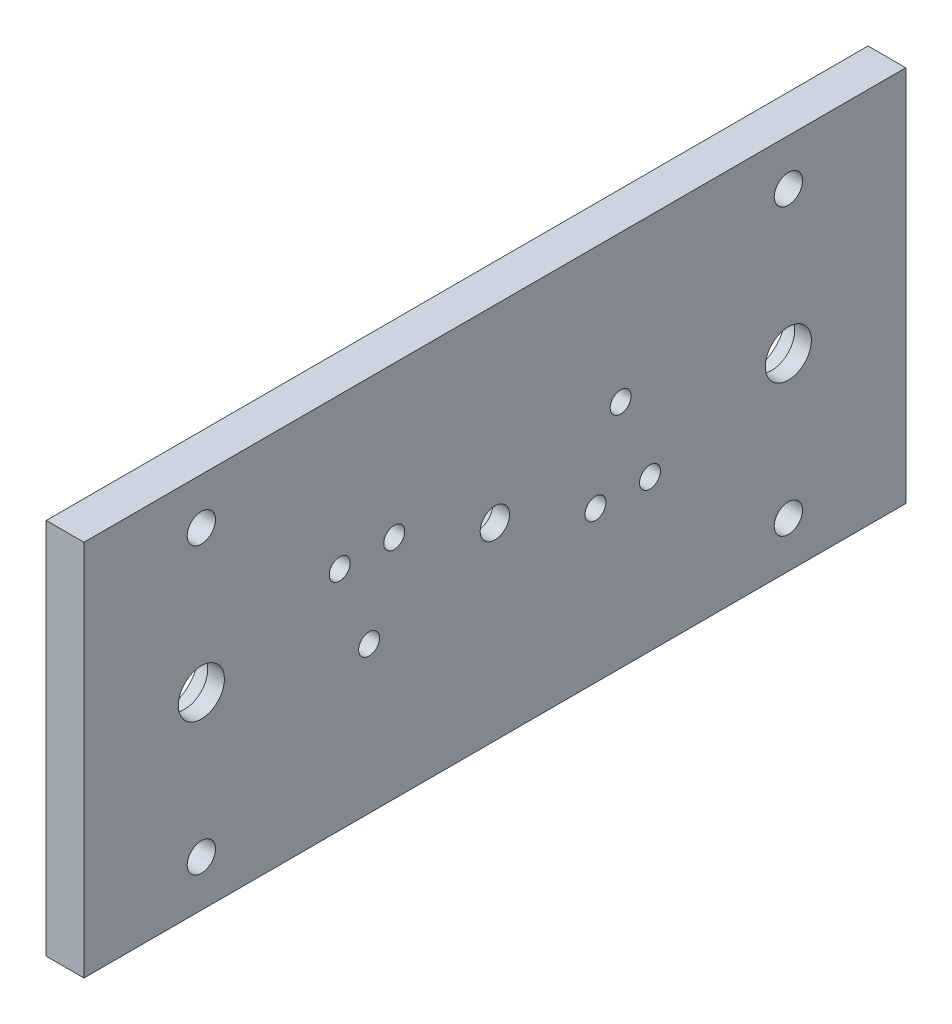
ISO-10303-21;
HEADER;
FILE_DESCRIPTION(('STEP AP214'),'2;1');
FILE_NAME('part.step','',(''),(''),'','','');
FILE_SCHEMA(('AUTOMOTIVE_DESIGN { 1 0 10303 214 1 1 1 1 }'));
ENDSEC;
DATA;
#1=APPLICATION_CONTEXT('core data for automotive mechanical design processes');
#2=APPLICATION_PROTOCOL_DEFINITION('international standard','automotive_design',2000,#1);
#3=PRODUCT_CONTEXT('',#1,'mechanical');
#4=PRODUCT('Part','Part','',(#3));
#5=PRODUCT_RELATED_PRODUCT_CATEGORY('part','',(#4));
#6=PRODUCT_DEFINITION_FORMATION('','',#4);
#7=PRODUCT_DEFINITION_CONTEXT('part definition',#1,'design');
#8=PRODUCT_DEFINITION('design','',#6,#7);
#9=PRODUCT_DEFINITION_SHAPE('','',#8);
#10=(LENGTH_UNIT() NAMED_UNIT(*) SI_UNIT(.MILLI.,.METRE.));
#11=(NAMED_UNIT(*) PLANE_ANGLE_UNIT() SI_UNIT($,.RADIAN.));
#12=(NAMED_UNIT(*) SI_UNIT($,.STERADIAN.) SOLID_ANGLE_UNIT());
#13=UNCERTAINTY_MEASURE_WITH_UNIT(LENGTH_MEASURE(1.E-05),#10,'distance_accuracy_value','');
#14=(GEOMETRIC_REPRESENTATION_CONTEXT(3) GLOBAL_UNCERTAINTY_ASSIGNED_CONTEXT((#13)) GLOBAL_UNIT_ASSIGNED_CONTEXT((#10,
#11,#12)) REPRESENTATION_CONTEXT('',''));
#15=CARTESIAN_POINT('',(0.,0.,0.));
#16=DIRECTION('',(0.,0.,1.));
#17=DIRECTION('',(1.,0.,0.));
#18=AXIS2_PLACEMENT_3D('',#15,#16,#17);
#19=CARTESIAN_POINT('',(-119.,78.,28.0000000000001));
#20=DIRECTION('',(-1.,0.,0.));
#21=DIRECTION('',(0.,0.,1.));
#22=AXIS2_PLACEMENT_3D('',#19,#20,#21);
#23=CYLINDRICAL_SURFACE('',#22,5.5);
#24=CARTESIAN_POINT('',(-119.,78.,28.0000000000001));
#25=DIRECTION('',(-1.,0.,0.));
#26=DIRECTION('',(0.,0.,1.));
#27=AXIS2_PLACEMENT_3D('',#24,#25,#26);
#28=CIRCLE('',#27,5.5);
#29=CARTESIAN_POINT('',(-119.,78.,33.5000000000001));
#30=VERTEX_POINT('',#29);
#31=EDGE_CURVE('E158',#30,#30,#28,.T.);
#32=ORIENTED_EDGE('',*,*,#31,.F.);
#33=EDGE_LOOP('',(#32));
#34=FACE_BOUND('',#33,.T.);
#35=CARTESIAN_POINT('',(-123.,78.,28.0000000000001));
#36=DIRECTION('',(-1.,0.,0.));
#37=DIRECTION('',(0.,0.,1.));
#38=AXIS2_PLACEMENT_3D('',#35,#36,#37);
#39=CIRCLE('',#38,5.5);
#40=CARTESIAN_POINT('',(-123.,78.,33.5000000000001));
#41=VERTEX_POINT('',#40);
#42=EDGE_CURVE('E32',#41,#41,#39,.F.);
#43=ORIENTED_EDGE('',*,*,#42,.F.);
#44=EDGE_LOOP('',(#43));
#45=FACE_BOUND('',#44,.T.);
#46=ADVANCED_FACE('F28',(#34,#45),#23,.F.);
#47=CARTESIAN_POINT('',(-119.,78.,168.));
#48=DIRECTION('',(-1.,0.,0.));
#49=DIRECTION('',(0.,0.,1.));
#50=AXIS2_PLACEMENT_3D('',#47,#48,#49);
#51=CYLINDRICAL_SURFACE('',#50,5.50000000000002);
#52=CARTESIAN_POINT('',(-119.,78.,168.));
#53=DIRECTION('',(-1.,0.,0.));
#54=DIRECTION('',(0.,0.,1.));
#55=AXIS2_PLACEMENT_3D('',#52,#53,#54);
#56=CIRCLE('',#55,5.50000000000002);
#57=CARTESIAN_POINT('',(-119.,78.,173.5));
#58=VERTEX_POINT('',#57);
#59=EDGE_CURVE('E163',#58,#58,#56,.T.);
#60=ORIENTED_EDGE('',*,*,#59,.F.);
#61=EDGE_LOOP('',(#60));
#62=FACE_BOUND('',#61,.T.);
#63=CARTESIAN_POINT('',(-123.,78.,168.));
#64=DIRECTION('',(-1.,0.,0.));
#65=DIRECTION('',(0.,0.,1.));
#66=AXIS2_PLACEMENT_3D('',#63,#64,#65);
#67=CIRCLE('',#66,5.50000000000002);
#68=CARTESIAN_POINT('',(-123.,78.,173.5));
#69=VERTEX_POINT('',#68);
#70=EDGE_CURVE('E156',#69,#69,#67,.F.);
#71=ORIENTED_EDGE('',*,*,#70,.F.);
#72=EDGE_LOOP('',(#71));
#73=FACE_BOUND('',#72,.T.);
#74=ADVANCED_FACE('F253',(#62,#73),#51,.F.);
#75=CARTESIAN_POINT('',(-128.,78.,98.0000000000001));
#76=DIRECTION('',(1.,0.,0.));
#77=DIRECTION('',(0.,0.,-1.));
#78=AXIS2_PLACEMENT_3D('',#75,#76,#77);
#79=CYLINDRICAL_SURFACE('',#78,3.50000000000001);
#80=CARTESIAN_POINT('',(-119.,78.,98.0000000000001));
#81=DIRECTION('',(1.,0.,0.));
#82=DIRECTION('',(0.,0.,-1.));
#83=AXIS2_PLACEMENT_3D('',#80,#81,#82);
#84=CIRCLE('',#83,3.50000000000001);
#85=CARTESIAN_POINT('',(-119.,78.,94.5000000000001));
#86=VERTEX_POINT('',#85);
#87=EDGE_CURVE('E121',#86,#86,#84,.T.);
#88=ORIENTED_EDGE('',*,*,#87,.T.);
#89=EDGE_LOOP('',(#88));
#90=FACE_BOUND('',#89,.T.);
#91=CARTESIAN_POINT('',(-123.,78.,98.0000000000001));
#92=DIRECTION('',(-1.,0.,0.));
#93=DIRECTION('',(0.,0.,1.));
#94=AXIS2_PLACEMENT_3D('',#91,#92,#93);
#95=CIRCLE('',#94,3.50000000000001);
#96=CARTESIAN_POINT('',(-123.,78.,101.5));
#97=VERTEX_POINT('',#96);
#98=EDGE_CURVE('E152',#97,#97,#95,.F.);
#99=ORIENTED_EDGE('',*,*,#98,.F.);
#100=EDGE_LOOP('',(#99));
#101=FACE_BOUND('',#100,.T.);
#102=ADVANCED_FACE('F259',(#90,#101),#79,.F.);
#103=CARTESIAN_POINT('',(-128.,88.,68.0000000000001));
#104=DIRECTION('',(1.,0.,0.));
#105=DIRECTION('',(0.,0.,-1.));
#106=AXIS2_PLACEMENT_3D('',#103,#104,#105);
#107=CYLINDRICAL_SURFACE('',#106,2.5);
#108=CARTESIAN_POINT('',(-119.,88.,68.0000000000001));
#109=DIRECTION('',(1.,0.,0.));
#110=DIRECTION('',(0.,0.,-1.));
#111=AXIS2_PLACEMENT_3D('',#108,#109,#110);
#112=CIRCLE('',#111,2.5);
#113=CARTESIAN_POINT('',(-119.,88.,65.5000000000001));
#114=VERTEX_POINT('',#113);
#115=EDGE_CURVE('E210',#114,#114,#112,.T.);
#116=ORIENTED_EDGE('',*,*,#115,.T.);
#117=EDGE_LOOP('',(#116));
#118=FACE_BOUND('',#117,.T.);
#119=CARTESIAN_POINT('',(-125.,88.,68.0000000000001));
#120=DIRECTION('',(-1.,0.,0.));
#121=DIRECTION('',(0.,0.,1.));
#122=AXIS2_PLACEMENT_3D('',#119,#120,#121);
#123=CIRCLE('',#122,2.5);
#124=CARTESIAN_POINT('',(-125.,88.,70.5000000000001));
#125=VERTEX_POINT('',#124);
#126=EDGE_CURVE('E147',#125,#125,#123,.F.);
#127=ORIENTED_EDGE('',*,*,#126,.F.);
#128=EDGE_LOOP('',(#127));
#129=FACE_BOUND('',#128,.T.);
#130=ADVANCED_FACE('F330',(#118,#129),#107,.F.);
#131=CARTESIAN_POINT('',(-128.,69.,61.0000000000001));
#132=DIRECTION('',(1.,0.,0.));
#133=DIRECTION('',(0.,0.,-1.));
#134=AXIS2_PLACEMENT_3D('',#131,#132,#133);
#135=CYLINDRICAL_SURFACE('',#134,2.5);
#136=CARTESIAN_POINT('',(-119.,69.,61.0000000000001));
#137=DIRECTION('',(1.,0.,0.));
#138=DIRECTION('',(0.,0.,-1.));
#139=AXIS2_PLACEMENT_3D('',#136,#137,#138);
#140=CIRCLE('',#139,2.5);
#141=CARTESIAN_POINT('',(-119.,69.,58.5000000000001));
#142=VERTEX_POINT('',#141);
#143=EDGE_CURVE('E125',#142,#142,#140,.T.);
#144=ORIENTED_EDGE('',*,*,#143,.T.);
#145=EDGE_LOOP('',(#144));
#146=FACE_BOUND('',#145,.T.);
#147=CARTESIAN_POINT('',(-125.,69.,61.0000000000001));
#148=DIRECTION('',(-1.,0.,0.));
#149=DIRECTION('',(0.,0.,1.));
#150=AXIS2_PLACEMENT_3D('',#147,#148,#149);
#151=CIRCLE('',#150,2.5);
#152=CARTESIAN_POINT('',(-125.,69.,63.5000000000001));
#153=VERTEX_POINT('',#152);
#154=EDGE_CURVE('E142',#153,#153,#151,.F.);
#155=ORIENTED_EDGE('',*,*,#154,.F.);
#156=EDGE_LOOP('',(#155));
#157=FACE_BOUND('',#156,.T.);
#158=ADVANCED_FACE('F326',(#146,#157),#135,.F.);
#159=CARTESIAN_POINT('',(-128.,69.,74.0000000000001));
#160=DIRECTION('',(1.,0.,0.));
#161=DIRECTION('',(0.,0.,-1.));
#162=AXIS2_PLACEMENT_3D('',#159,#160,#161);
#163=CYLINDRICAL_SURFACE('',#162,2.50000000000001);
#164=CARTESIAN_POINT('',(-119.,69.,74.0000000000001));
#165=DIRECTION('',(1.,0.,0.));
#166=DIRECTION('',(0.,0.,-1.));
#167=AXIS2_PLACEMENT_3D('',#164,#165,#166);
#168=CIRCLE('',#167,2.50000000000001);
#169=CARTESIAN_POINT('',(-119.,69.,71.5));
#170=VERTEX_POINT('',#169);
#171=EDGE_CURVE('E207',#170,#170,#168,.T.);
#172=ORIENTED_EDGE('',*,*,#171,.T.);
#173=EDGE_LOOP('',(#172));
#174=FACE_BOUND('',#173,.T.);
#175=CARTESIAN_POINT('',(-125.,69.,74.0000000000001));
#176=DIRECTION('',(-1.,0.,0.));
#177=DIRECTION('',(0.,0.,1.));
#178=AXIS2_PLACEMENT_3D('',#175,#176,#177);
#179=CIRCLE('',#178,2.50000000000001);
#180=CARTESIAN_POINT('',(-125.,69.,76.5000000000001));
#181=VERTEX_POINT('',#180);
#182=EDGE_CURVE('E137',#181,#181,#179,.F.);
#183=ORIENTED_EDGE('',*,*,#182,.F.);
#184=EDGE_LOOP('',(#183));
#185=FACE_BOUND('',#184,.T.);
#186=ADVANCED_FACE('F329',(#174,#185),#163,.F.);
#187=CARTESIAN_POINT('',(-128.,68.,128.));
#188=DIRECTION('',(1.,0.,0.));
#189=DIRECTION('',(0.,0.,-1.));
#190=AXIS2_PLACEMENT_3D('',#187,#188,#189);
#191=CYLINDRICAL_SURFACE('',#190,2.5);
#192=CARTESIAN_POINT('',(-119.,68.,128.));
#193=DIRECTION('',(1.,0.,0.));
#194=DIRECTION('',(0.,0.,-1.));
#195=AXIS2_PLACEMENT_3D('',#192,#193,#194);
#196=CIRCLE('',#195,2.5);
#197=CARTESIAN_POINT('',(-119.,68.,125.5));
#198=VERTEX_POINT('',#197);
#199=EDGE_CURVE('E213',#198,#198,#196,.T.);
#200=ORIENTED_EDGE('',*,*,#199,.T.);
#201=EDGE_LOOP('',(#200));
#202=FACE_BOUND('',#201,.T.);
#203=CARTESIAN_POINT('',(-125.,68.,128.));
#204=DIRECTION('',(-1.,0.,0.));
#205=DIRECTION('',(0.,0.,1.));
#206=AXIS2_PLACEMENT_3D('',#203,#204,#205);
#207=CIRCLE('',#206,2.5);
#208=CARTESIAN_POINT('',(-125.,68.,130.5));
#209=VERTEX_POINT('',#208);
#210=EDGE_CURVE('E132',#209,#209,#207,.F.);
#211=ORIENTED_EDGE('',*,*,#210,.F.);
#212=EDGE_LOOP('',(#211));
#213=FACE_BOUND('',#212,.T.);
#214=ADVANCED_FACE('F334',(#202,#213),#191,.F.);
#215=CARTESIAN_POINT('',(-128.,87.,122.));
#216=DIRECTION('',(1.,0.,0.));
#217=DIRECTION('',(0.,0.,-1.));
#218=AXIS2_PLACEMENT_3D('',#215,#216,#217);
#219=CYLINDRICAL_SURFACE('',#218,2.50000000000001);
#220=CARTESIAN_POINT('',(-119.,87.,122.));
#221=DIRECTION('',(1.,0.,0.));
#222=DIRECTION('',(0.,0.,-1.));
#223=AXIS2_PLACEMENT_3D('',#220,#221,#222);
#224=CIRCLE('',#223,2.50000000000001);
#225=CARTESIAN_POINT('',(-119.,87.,119.5));
#226=VERTEX_POINT('',#225);
#227=EDGE_CURVE('E216',#226,#226,#224,.T.);
#228=ORIENTED_EDGE('',*,*,#227,.T.);
#229=EDGE_LOOP('',(#228));
#230=FACE_BOUND('',#229,.T.);
#231=CARTESIAN_POINT('',(-125.,87.,122.));
#232=DIRECTION('',(-1.,0.,0.));
#233=DIRECTION('',(0.,0.,1.));
#234=AXIS2_PLACEMENT_3D('',#231,#232,#233);
#235=CIRCLE('',#234,2.50000000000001);
#236=CARTESIAN_POINT('',(-125.,87.,124.5));
#237=VERTEX_POINT('',#236);
#238=EDGE_CURVE('E127',#237,#237,#235,.F.);
#239=ORIENTED_EDGE('',*,*,#238,.F.);
#240=EDGE_LOOP('',(#239));
#241=FACE_BOUND('',#240,.T.);
#242=ADVANCED_FACE('F341',(#230,#241),#219,.F.);
#243=CARTESIAN_POINT('',(-128.,87.,135.));
#244=DIRECTION('',(1.,0.,0.));
#245=DIRECTION('',(0.,0.,-1.));
#246=AXIS2_PLACEMENT_3D('',#243,#244,#245);
#247=CYLINDRICAL_SURFACE('',#246,2.5);
#248=CARTESIAN_POINT('',(-119.,87.,135.));
#249=DIRECTION('',(1.,0.,0.));
#250=DIRECTION('',(0.,0.,-1.));
#251=AXIS2_PLACEMENT_3D('',#248,#249,#250);
#252=CIRCLE('',#251,2.5);
#253=CARTESIAN_POINT('',(-119.,87.,132.5));
#254=VERTEX_POINT('',#253);
#255=EDGE_CURVE('E219',#254,#254,#252,.T.);
#256=ORIENTED_EDGE('',*,*,#255,.T.);
#257=EDGE_LOOP('',(#256));
#258=FACE_BOUND('',#257,.T.);
#259=CARTESIAN_POINT('',(-125.,87.,135.));
#260=DIRECTION('',(-1.,0.,0.));
#261=DIRECTION('',(0.,0.,1.));
#262=AXIS2_PLACEMENT_3D('',#259,#260,#261);
#263=CIRCLE('',#262,2.5);
#264=CARTESIAN_POINT('',(-125.,87.,137.5));
#265=VERTEX_POINT('',#264);
#266=EDGE_CURVE('E122',#265,#265,#263,.F.);
#267=ORIENTED_EDGE('',*,*,#266,.F.);
#268=EDGE_LOOP('',(#267));
#269=FACE_BOUND('',#268,.T.);
#270=ADVANCED_FACE('F237',(#258,#269),#247,.F.);
#271=CARTESIAN_POINT('',(-128.,78.,98.0000000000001));
#272=DIRECTION('',(-1.,0.,0.));
#273=DIRECTION('',(0.,0.,1.));
#274=AXIS2_PLACEMENT_3D('',#271,#272,#273);
#275=PLANE('',#274);
#276=CARTESIAN_POINT('',(-128.,78.,28.));
#277=DIRECTION('',(-1.,0.,0.));
#278=DIRECTION('',(0.,0.,1.));
#279=AXIS2_PLACEMENT_3D('',#276,#277,#278);
#280=CIRCLE('',#279,8.5);
#281=CARTESIAN_POINT('',(-128.,78.,36.5));
#282=VERTEX_POINT('',#281);
#283=EDGE_CURVE('E481',#282,#282,#280,.T.);
#284=ORIENTED_EDGE('',*,*,#283,.F.);
#285=EDGE_LOOP('',(#284));
#286=FACE_BOUND('',#285,.T.);
#287=CARTESIAN_POINT('',(-128.,78.,168.));
#288=DIRECTION('',(-1.,0.,0.));
#289=DIRECTION('',(0.,0.,1.));
#290=AXIS2_PLACEMENT_3D('',#287,#288,#289);
#291=CIRCLE('',#290,8.50000000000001);
#292=CARTESIAN_POINT('',(-128.,78.,176.5));
#293=VERTEX_POINT('',#292);
#294=EDGE_CURVE('E166',#293,#293,#291,.T.);
#295=ORIENTED_EDGE('',*,*,#294,.F.);
#296=EDGE_LOOP('',(#295));
#297=FACE_BOUND('',#296,.T.);
#298=CARTESIAN_POINT('',(-128.,78.,98.0000000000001));
#299=DIRECTION('',(-1.,0.,0.));
#300=DIRECTION('',(0.,0.,1.));
#301=AXIS2_PLACEMENT_3D('',#298,#299,#300);
#302=CIRCLE('',#301,6.5);
#303=CARTESIAN_POINT('',(-128.,78.,104.5));
#304=VERTEX_POINT('',#303);
#305=EDGE_CURVE('E176',#304,#304,#302,.T.);
#306=ORIENTED_EDGE('',*,*,#305,.F.);
#307=EDGE_LOOP('',(#306));
#308=FACE_BOUND('',#307,.T.);
#309=CARTESIAN_POINT('',(-128.,88.,68.0000000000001));
#310=DIRECTION('',(-1.,0.,0.));
#311=DIRECTION('',(0.,0.,1.));
#312=AXIS2_PLACEMENT_3D('',#309,#310,#311);
#313=CIRCLE('',#312,4.50000000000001);
#314=CARTESIAN_POINT('',(-128.,88.,72.5000000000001));
#315=VERTEX_POINT('',#314);
#316=EDGE_CURVE('E154',#315,#315,#313,.T.);
#317=ORIENTED_EDGE('',*,*,#316,.F.);
#318=EDGE_LOOP('',(#317));
#319=FACE_BOUND('',#318,.T.);
#320=CARTESIAN_POINT('',(-128.,69.,61.0000000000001));
#321=DIRECTION('',(-1.,0.,0.));
#322=DIRECTION('',(0.,0.,1.));
#323=AXIS2_PLACEMENT_3D('',#320,#321,#322);
#324=CIRCLE('',#323,4.50000000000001);
#325=CARTESIAN_POINT('',(-128.,69.,65.5000000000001));
#326=VERTEX_POINT('',#325);
#327=EDGE_CURVE('E150',#326,#326,#324,.T.);
#328=ORIENTED_EDGE('',*,*,#327,.F.);
#329=EDGE_LOOP('',(#328));
#330=FACE_BOUND('',#329,.T.);
#331=CARTESIAN_POINT('',(-128.,69.,74.0000000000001));
#332=DIRECTION('',(-1.,0.,0.));
#333=DIRECTION('',(0.,0.,1.));
#334=AXIS2_PLACEMENT_3D('',#331,#332,#333);
#335=CIRCLE('',#334,4.50000000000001);
#336=CARTESIAN_POINT('',(-128.,69.,78.5000000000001));
#337=VERTEX_POINT('',#336);
#338=EDGE_CURVE('E145',#337,#337,#335,.T.);
#339=ORIENTED_EDGE('',*,*,#338,.F.);
#340=EDGE_LOOP('',(#339));
#341=FACE_BOUND('',#340,.T.);
#342=CARTESIAN_POINT('',(-128.,68.,128.));
#343=DIRECTION('',(-1.,0.,0.));
#344=DIRECTION('',(0.,0.,1.));
#345=AXIS2_PLACEMENT_3D('',#342,#343,#344);
#346=CIRCLE('',#345,4.49999999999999);
#347=CARTESIAN_POINT('',(-128.,68.,132.5));
#348=VERTEX_POINT('',#347);
#349=EDGE_CURVE('E140',#348,#348,#346,.T.);
#350=ORIENTED_EDGE('',*,*,#349,.F.);
#351=EDGE_LOOP('',(#350));
#352=FACE_BOUND('',#351,.T.);
#353=CARTESIAN_POINT('',(-128.,87.,122.));
#354=DIRECTION('',(-1.,0.,0.));
#355=DIRECTION('',(0.,0.,1.));
#356=AXIS2_PLACEMENT_3D('',#353,#354,#355);
#357=CIRCLE('',#356,4.49999999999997);
#358=CARTESIAN_POINT('',(-128.,87.,126.5));
#359=VERTEX_POINT('',#358);
#360=EDGE_CURVE('E135',#359,#359,#357,.T.);
#361=ORIENTED_EDGE('',*,*,#360,.F.);
#362=EDGE_LOOP('',(#361));
#363=FACE_BOUND('',#362,.T.);
#364=CARTESIAN_POINT('',(-128.,87.,135.));
#365=DIRECTION('',(-1.,0.,0.));
#366=DIRECTION('',(0.,0.,1.));
#367=AXIS2_PLACEMENT_3D('',#364,#365,#366);
#368=CIRCLE('',#367,4.49999999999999);
#369=CARTESIAN_POINT('',(-128.,87.,139.5));
#370=VERTEX_POINT('',#369);
#371=EDGE_CURVE('E130',#370,#370,#368,.T.);
#372=ORIENTED_EDGE('',*,*,#371,.F.);
#373=EDGE_LOOP('',(#372));
#374=FACE_BOUND('',#373,.T.);
#375=CARTESIAN_POINT('',(-128.,112.,168.));
#376=DIRECTION('',(-1.,0.,0.));
#377=DIRECTION('',(0.,0.,1.));
#378=AXIS2_PLACEMENT_3D('',#375,#376,#377);
#379=CIRCLE('',#378,3.375);
#380=CARTESIAN_POINT('',(-128.,112.,171.375));
#381=VERTEX_POINT('',#380);
#382=EDGE_CURVE('E117',#381,#381,#379,.T.);
#383=ORIENTED_EDGE('',*,*,#382,.F.);
#384=EDGE_LOOP('',(#383));
#385=FACE_BOUND('',#384,.T.);
#386=CARTESIAN_POINT('',(-128.,112.,28.));
#387=DIRECTION('',(-1.,0.,0.));
#388=DIRECTION('',(0.,0.,1.));
#389=AXIS2_PLACEMENT_3D('',#386,#387,#388);
#390=CIRCLE('',#389,3.375);
#391=CARTESIAN_POINT('',(-128.,112.,31.375));
#392=VERTEX_POINT('',#391);
#393=EDGE_CURVE('E113',#392,#392,#390,.T.);
#394=ORIENTED_EDGE('',*,*,#393,.F.);
#395=EDGE_LOOP('',(#394));
#396=FACE_BOUND('',#395,.T.);
#397=CARTESIAN_POINT('',(-128.,44.,168.));
#398=DIRECTION('',(-1.,0.,0.));
#399=DIRECTION('',(0.,0.,1.));
#400=AXIS2_PLACEMENT_3D('',#397,#398,#399);
#401=CIRCLE('',#400,3.375);
#402=CARTESIAN_POINT('',(-128.,44.,171.375));
#403=VERTEX_POINT('',#402);
#404=EDGE_CURVE('E109',#403,#403,#401,.T.);
#405=ORIENTED_EDGE('',*,*,#404,.F.);
#406=EDGE_LOOP('',(#405));
#407=FACE_BOUND('',#406,.T.);
#408=CARTESIAN_POINT('',(-128.,44.,28.));
#409=DIRECTION('',(-1.,0.,0.));
#410=DIRECTION('',(0.,0.,1.));
#411=AXIS2_PLACEMENT_3D('',#408,#409,#410);
#412=CIRCLE('',#411,3.375);
#413=CARTESIAN_POINT('',(-128.,44.,31.375));
#414=VERTEX_POINT('',#413);
#415=EDGE_CURVE('E86',#414,#414,#412,.T.);
#416=ORIENTED_EDGE('',*,*,#415,.F.);
#417=EDGE_LOOP('',(#416));
#418=FACE_BOUND('',#417,.T.);
#419=DIRECTION('',(0.,0.,-1.));
#420=VECTOR('',#419,1.);
#421=CARTESIAN_POINT('',(-128.,33.,98.0000000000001));
#422=LINE('',#421,#420);
#423=CARTESIAN_POINT('',(-128.,33.,196.));
#424=VERTEX_POINT('',#423);
#425=CARTESIAN_POINT('',(-128.,33.,0.));
#426=VERTEX_POINT('',#425);
#427=EDGE_CURVE('E11',#424,#426,#422,.T.);
#428=ORIENTED_EDGE('',*,*,#427,.F.);
#429=DIRECTION('',(0.,-1.,0.));
#430=VECTOR('',#429,1.);
#431=CARTESIAN_POINT('',(-128.,78.,196.));
#432=LINE('',#431,#430);
#433=CARTESIAN_POINT('',(-128.,123.,196.));
#434=VERTEX_POINT('',#433);
#435=EDGE_CURVE('E75',#434,#424,#432,.T.);
#436=ORIENTED_EDGE('',*,*,#435,.F.);
#437=DIRECTION('',(0.,0.,1.));
#438=VECTOR('',#437,1.);
#439=CARTESIAN_POINT('',(-128.,123.,98.0000000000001));
#440=LINE('',#439,#438);
#441=CARTESIAN_POINT('',(-128.,123.,0.));
#442=VERTEX_POINT('',#441);
#443=EDGE_CURVE('E103',#442,#434,#440,.T.);
#444=ORIENTED_EDGE('',*,*,#443,.F.);
#445=DIRECTION('',(0.,1.,0.));
#446=VECTOR('',#445,1.);
#447=CARTESIAN_POINT('',(-128.,78.,0.));
#448=LINE('',#447,#446);
#449=EDGE_CURVE('E37',#426,#442,#448,.T.);
#450=ORIENTED_EDGE('',*,*,#449,.F.);
#451=EDGE_LOOP('',(#428,#436,#444,#450));
#452=FACE_BOUND('',#451,.T.);
#453=ADVANCED_FACE('F30',(#286,#297,#308,#319,#330,#341,#352,#363,#374,#385,#396,#407,#418,
#452),#275,.T.);
#454=CARTESIAN_POINT('',(-119.,33.,98.0000000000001));
#455=DIRECTION('',(0.,-1.,0.));
#456=DIRECTION('',(1.,0.,0.));
#457=AXIS2_PLACEMENT_3D('',#454,#455,#456);
#458=PLANE('',#457);
#459=DIRECTION('',(-1.,0.,0.));
#460=VECTOR('',#459,1.);
#461=CARTESIAN_POINT('',(-119.,33.,196.));
#462=LINE('',#461,#460);
#463=CARTESIAN_POINT('',(-119.,33.,196.));
#464=VERTEX_POINT('',#463);
#465=EDGE_CURVE('E68',#464,#424,#462,.T.);
#466=ORIENTED_EDGE('',*,*,#465,.T.);
#467=ORIENTED_EDGE('',*,*,#427,.T.);
#468=DIRECTION('',(-1.,0.,0.));
#469=VECTOR('',#468,1.);
#470=CARTESIAN_POINT('',(-119.,33.,0.));
#471=LINE('',#470,#469);
#472=CARTESIAN_POINT('',(-119.,33.,0.));
#473=VERTEX_POINT('',#472);
#474=EDGE_CURVE('E81',#473,#426,#471,.T.);
#475=ORIENTED_EDGE('',*,*,#474,.F.);
#476=DIRECTION('',(0.,0.,1.));
#477=VECTOR('',#476,1.);
#478=CARTESIAN_POINT('',(-119.,33.,98.0000000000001));
#479=LINE('',#478,#477);
#480=EDGE_CURVE('E79',#473,#464,#479,.T.);
#481=ORIENTED_EDGE('',*,*,#480,.T.);
#482=EDGE_LOOP('',(#466,#467,#475,#481));
#483=FACE_BOUND('',#482,.T.);
#484=ADVANCED_FACE('F80',(#483),#458,.T.);
#485=CARTESIAN_POINT('',(-119.,78.,0.));
#486=DIRECTION('',(0.,0.,-1.));
#487=DIRECTION('',(-1.,0.,0.));
#488=AXIS2_PLACEMENT_3D('',#485,#486,#487);
#489=PLANE('',#488);
#490=ORIENTED_EDGE('',*,*,#474,.T.);
#491=ORIENTED_EDGE('',*,*,#449,.T.);
#492=DIRECTION('',(-1.,0.,0.));
#493=VECTOR('',#492,1.);
#494=CARTESIAN_POINT('',(-119.,123.,0.));
#495=LINE('',#494,#493);
#496=CARTESIAN_POINT('',(-119.,123.,0.));
#497=VERTEX_POINT('',#496);
#498=EDGE_CURVE('E98',#497,#442,#495,.T.);
#499=ORIENTED_EDGE('',*,*,#498,.F.);
#500=DIRECTION('',(0.,-1.,0.));
#501=VECTOR('',#500,1.);
#502=CARTESIAN_POINT('',(-119.,78.,0.));
#503=LINE('',#502,#501);
#504=EDGE_CURVE('E85',#497,#473,#503,.T.);
#505=ORIENTED_EDGE('',*,*,#504,.T.);
#506=EDGE_LOOP('',(#490,#491,#499,#505));
#507=FACE_BOUND('',#506,.T.);
#508=ADVANCED_FACE('F239',(#507),#489,.T.);
#509=CARTESIAN_POINT('',(-119.,123.,98.0000000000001));
#510=DIRECTION('',(0.,1.,0.));
#511=DIRECTION('',(-1.,0.,0.));
#512=AXIS2_PLACEMENT_3D('',#509,#510,#511);
#513=PLANE('',#512);
#514=ORIENTED_EDGE('',*,*,#498,.T.);
#515=ORIENTED_EDGE('',*,*,#443,.T.);
#516=DIRECTION('',(-1.,0.,0.));
#517=VECTOR('',#516,1.);
#518=CARTESIAN_POINT('',(-119.,123.,196.));
#519=LINE('',#518,#517);
#520=CARTESIAN_POINT('',(-119.,123.,196.));
#521=VERTEX_POINT('',#520);
#522=EDGE_CURVE('E76',#521,#434,#519,.T.);
#523=ORIENTED_EDGE('',*,*,#522,.F.);
#524=DIRECTION('',(0.,0.,-1.));
#525=VECTOR('',#524,1.);
#526=CARTESIAN_POINT('',(-119.,123.,98.0000000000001));
#527=LINE('',#526,#525);
#528=EDGE_CURVE('E91',#521,#497,#527,.T.);
#529=ORIENTED_EDGE('',*,*,#528,.T.);
#530=EDGE_LOOP('',(#514,#515,#523,#529));
#531=FACE_BOUND('',#530,.T.);
#532=ADVANCED_FACE('F241',(#531),#513,.T.);
#533=CARTESIAN_POINT('',(-119.,78.,98.0000000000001));
#534=DIRECTION('',(1.,0.,0.));
#535=DIRECTION('',(0.,0.,-1.));
#536=AXIS2_PLACEMENT_3D('',#533,#534,#535);
#537=PLANE('',#536);
#538=ORIENTED_EDGE('',*,*,#31,.T.);
#539=EDGE_LOOP('',(#538));
#540=FACE_BOUND('',#539,.T.);
#541=ORIENTED_EDGE('',*,*,#59,.T.);
#542=EDGE_LOOP('',(#541));
#543=FACE_BOUND('',#542,.T.);
#544=ORIENTED_EDGE('',*,*,#143,.F.);
#545=EDGE_LOOP('',(#544));
#546=FACE_BOUND('',#545,.T.);
#547=ORIENTED_EDGE('',*,*,#171,.F.);
#548=EDGE_LOOP('',(#547));
#549=FACE_BOUND('',#548,.T.);
#550=ORIENTED_EDGE('',*,*,#115,.F.);
#551=EDGE_LOOP('',(#550));
#552=FACE_BOUND('',#551,.T.);
#553=ORIENTED_EDGE('',*,*,#199,.F.);
#554=EDGE_LOOP('',(#553));
#555=FACE_BOUND('',#554,.T.);
#556=ORIENTED_EDGE('',*,*,#227,.F.);
#557=EDGE_LOOP('',(#556));
#558=FACE_BOUND('',#557,.T.);
#559=ORIENTED_EDGE('',*,*,#255,.F.);
#560=EDGE_LOOP('',(#559));
#561=FACE_BOUND('',#560,.T.);
#562=ORIENTED_EDGE('',*,*,#87,.F.);
#563=EDGE_LOOP('',(#562));
#564=FACE_BOUND('',#563,.T.);
#565=CARTESIAN_POINT('',(-119.,112.,168.));
#566=DIRECTION('',(1.,0.,0.));
#567=DIRECTION('',(0.,0.,-1.));
#568=AXIS2_PLACEMENT_3D('',#565,#566,#567);
#569=CIRCLE('',#568,3.375);
#570=CARTESIAN_POINT('',(-119.,112.,164.625));
#571=VERTEX_POINT('',#570);
#572=EDGE_CURVE('E118',#571,#571,#569,.T.);
#573=ORIENTED_EDGE('',*,*,#572,.F.);
#574=EDGE_LOOP('',(#573));
#575=FACE_BOUND('',#574,.T.);
#576=CARTESIAN_POINT('',(-119.,112.,28.0000000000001));
#577=DIRECTION('',(1.,0.,0.));
#578=DIRECTION('',(0.,0.,-1.));
#579=AXIS2_PLACEMENT_3D('',#576,#577,#578);
#580=CIRCLE('',#579,3.375);
#581=CARTESIAN_POINT('',(-119.,112.,24.625));
#582=VERTEX_POINT('',#581);
#583=EDGE_CURVE('E114',#582,#582,#580,.T.);
#584=ORIENTED_EDGE('',*,*,#583,.F.);
#585=EDGE_LOOP('',(#584));
#586=FACE_BOUND('',#585,.T.);
#587=CARTESIAN_POINT('',(-119.,44.,168.));
#588=DIRECTION('',(1.,0.,0.));
#589=DIRECTION('',(0.,0.,-1.));
#590=AXIS2_PLACEMENT_3D('',#587,#588,#589);
#591=CIRCLE('',#590,3.375);
#592=CARTESIAN_POINT('',(-119.,44.,164.625));
#593=VERTEX_POINT('',#592);
#594=EDGE_CURVE('E110',#593,#593,#591,.T.);
#595=ORIENTED_EDGE('',*,*,#594,.F.);
#596=EDGE_LOOP('',(#595));
#597=FACE_BOUND('',#596,.T.);
#598=CARTESIAN_POINT('',(-119.,44.,28.0000000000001));
#599=DIRECTION('',(1.,0.,0.));
#600=DIRECTION('',(0.,0.,-1.));
#601=AXIS2_PLACEMENT_3D('',#598,#599,#600);
#602=CIRCLE('',#601,3.375);
#603=CARTESIAN_POINT('',(-119.,44.,24.625));
#604=VERTEX_POINT('',#603);
#605=EDGE_CURVE('E106',#604,#604,#602,.T.);
#606=ORIENTED_EDGE('',*,*,#605,.F.);
#607=EDGE_LOOP('',(#606));
#608=FACE_BOUND('',#607,.T.);
#609=DIRECTION('',(0.,1.,0.));
#610=VECTOR('',#609,1.);
#611=CARTESIAN_POINT('',(-119.,78.,196.));
#612=LINE('',#611,#610);
#613=EDGE_CURVE('E73',#464,#521,#612,.T.);
#614=ORIENTED_EDGE('',*,*,#613,.F.);
#615=ORIENTED_EDGE('',*,*,#480,.F.);
#616=ORIENTED_EDGE('',*,*,#504,.F.);
#617=ORIENTED_EDGE('',*,*,#528,.F.);
#618=EDGE_LOOP('',(#614,#615,#616,#617));
#619=FACE_BOUND('',#618,.T.);
#620=ADVANCED_FACE('F89',(#540,#543,#546,#549,#552,#555,#558,#561,#564,#575,#586,#597,#608,
#619),#537,.T.);
#621=CARTESIAN_POINT('',(-119.,78.,196.));
#622=DIRECTION('',(0.,0.,1.));
#623=DIRECTION('',(1.,0.,0.));
#624=AXIS2_PLACEMENT_3D('',#621,#622,#623);
#625=PLANE('',#624);
#626=ORIENTED_EDGE('',*,*,#613,.T.);
#627=ORIENTED_EDGE('',*,*,#522,.T.);
#628=ORIENTED_EDGE('',*,*,#435,.T.);
#629=ORIENTED_EDGE('',*,*,#465,.F.);
#630=EDGE_LOOP('',(#626,#627,#628,#629));
#631=FACE_BOUND('',#630,.T.);
#632=ADVANCED_FACE('F70',(#631),#625,.T.);
#633=CARTESIAN_POINT('',(-129.,44.,28.));
#634=DIRECTION('',(1.,0.,0.));
#635=DIRECTION('',(0.,-1.,0.));
#636=AXIS2_PLACEMENT_3D('',#633,#634,#635);
#637=CYLINDRICAL_SURFACE('',#636,3.375);
#638=ORIENTED_EDGE('',*,*,#415,.T.);
#639=EDGE_LOOP('',(#638));
#640=FACE_BOUND('',#639,.T.);
#641=ORIENTED_EDGE('',*,*,#605,.T.);
#642=EDGE_LOOP('',(#641));
#643=FACE_BOUND('',#642,.T.);
#644=ADVANCED_FACE('F232',(#640,#643),#637,.F.);
#645=CARTESIAN_POINT('',(-129.,44.,168.));
#646=DIRECTION('',(1.,0.,0.));
#647=DIRECTION('',(0.,-1.,0.));
#648=AXIS2_PLACEMENT_3D('',#645,#646,#647);
#649=CYLINDRICAL_SURFACE('',#648,3.375);
#650=ORIENTED_EDGE('',*,*,#404,.T.);
#651=EDGE_LOOP('',(#650));
#652=FACE_BOUND('',#651,.T.);
#653=ORIENTED_EDGE('',*,*,#594,.T.);
#654=EDGE_LOOP('',(#653));
#655=FACE_BOUND('',#654,.T.);
#656=ADVANCED_FACE('F358',(#652,#655),#649,.F.);
#657=CARTESIAN_POINT('',(-129.,112.,28.));
#658=DIRECTION('',(1.,0.,0.));
#659=DIRECTION('',(0.,-1.,0.));
#660=AXIS2_PLACEMENT_3D('',#657,#658,#659);
#661=CYLINDRICAL_SURFACE('',#660,3.375);
#662=ORIENTED_EDGE('',*,*,#393,.T.);
#663=EDGE_LOOP('',(#662));
#664=FACE_BOUND('',#663,.T.);
#665=ORIENTED_EDGE('',*,*,#583,.T.);
#666=EDGE_LOOP('',(#665));
#667=FACE_BOUND('',#666,.T.);
#668=ADVANCED_FACE('F354',(#664,#667),#661,.F.);
#669=CARTESIAN_POINT('',(-129.,112.,168.));
#670=DIRECTION('',(1.,0.,0.));
#671=DIRECTION('',(0.,-1.,0.));
#672=AXIS2_PLACEMENT_3D('',#669,#670,#671);
#673=CYLINDRICAL_SURFACE('',#672,3.375);
#674=ORIENTED_EDGE('',*,*,#382,.T.);
#675=EDGE_LOOP('',(#674));
#676=FACE_BOUND('',#675,.T.);
#677=ORIENTED_EDGE('',*,*,#572,.T.);
#678=EDGE_LOOP('',(#677));
#679=FACE_BOUND('',#678,.T.);
#680=ADVANCED_FACE('F321',(#676,#679),#673,.F.);
#681=CARTESIAN_POINT('',(-125.,87.,135.));
#682=DIRECTION('',(-1.,0.,0.));
#683=DIRECTION('',(0.,0.,1.));
#684=AXIS2_PLACEMENT_3D('',#681,#682,#683);
#685=PLANE('',#684);
#686=CARTESIAN_POINT('',(-125.,87.,135.));
#687=DIRECTION('',(-1.,0.,0.));
#688=DIRECTION('',(0.,0.,1.));
#689=AXIS2_PLACEMENT_3D('',#686,#687,#688);
#690=CIRCLE('',#689,4.49999999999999);
#691=CARTESIAN_POINT('',(-125.,87.,139.5));
#692=VERTEX_POINT('',#691);
#693=EDGE_CURVE('E126',#692,#692,#690,.T.);
#694=ORIENTED_EDGE('',*,*,#693,.T.);
#695=EDGE_LOOP('',(#694));
#696=FACE_BOUND('',#695,.T.);
#697=ORIENTED_EDGE('',*,*,#266,.T.);
#698=EDGE_LOOP('',(#697));
#699=FACE_BOUND('',#698,.T.);
#700=ADVANCED_FACE('F318',(#696,#699),#685,.T.);
#701=CARTESIAN_POINT('',(-125.,87.,135.));
#702=DIRECTION('',(-1.,0.,0.));
#703=DIRECTION('',(0.,0.,1.));
#704=AXIS2_PLACEMENT_3D('',#701,#702,#703);
#705=CYLINDRICAL_SURFACE('',#704,4.49999999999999);
#706=ORIENTED_EDGE('',*,*,#693,.F.);
#707=EDGE_LOOP('',(#706));
#708=FACE_BOUND('',#707,.T.);
#709=ORIENTED_EDGE('',*,*,#371,.T.);
#710=EDGE_LOOP('',(#709));
#711=FACE_BOUND('',#710,.T.);
#712=ADVANCED_FACE('F313',(#708,#711),#705,.F.);
#713=CARTESIAN_POINT('',(-125.,87.,122.));
#714=DIRECTION('',(-1.,0.,0.));
#715=DIRECTION('',(0.,0.,1.));
#716=AXIS2_PLACEMENT_3D('',#713,#714,#715);
#717=PLANE('',#716);
#718=CARTESIAN_POINT('',(-125.,87.,122.));
#719=DIRECTION('',(-1.,0.,0.));
#720=DIRECTION('',(0.,0.,1.));
#721=AXIS2_PLACEMENT_3D('',#718,#719,#720);
#722=CIRCLE('',#721,4.49999999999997);
#723=CARTESIAN_POINT('',(-125.,87.,126.5));
#724=VERTEX_POINT('',#723);
#725=EDGE_CURVE('E131',#724,#724,#722,.T.);
#726=ORIENTED_EDGE('',*,*,#725,.T.);
#727=EDGE_LOOP('',(#726));
#728=FACE_BOUND('',#727,.T.);
#729=ORIENTED_EDGE('',*,*,#238,.T.);
#730=EDGE_LOOP('',(#729));
#731=FACE_BOUND('',#730,.T.);
#732=ADVANCED_FACE('F310',(#728,#731),#717,.T.);
#733=CARTESIAN_POINT('',(-125.,87.,122.));
#734=DIRECTION('',(-1.,0.,0.));
#735=DIRECTION('',(0.,0.,1.));
#736=AXIS2_PLACEMENT_3D('',#733,#734,#735);
#737=CYLINDRICAL_SURFACE('',#736,4.49999999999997);
#738=ORIENTED_EDGE('',*,*,#725,.F.);
#739=EDGE_LOOP('',(#738));
#740=FACE_BOUND('',#739,.T.);
#741=ORIENTED_EDGE('',*,*,#360,.T.);
#742=EDGE_LOOP('',(#741));
#743=FACE_BOUND('',#742,.T.);
#744=ADVANCED_FACE('F305',(#740,#743),#737,.F.);
#745=CARTESIAN_POINT('',(-125.,68.,128.));
#746=DIRECTION('',(-1.,0.,0.));
#747=DIRECTION('',(0.,0.,1.));
#748=AXIS2_PLACEMENT_3D('',#745,#746,#747);
#749=PLANE('',#748);
#750=CARTESIAN_POINT('',(-125.,68.,128.));
#751=DIRECTION('',(-1.,0.,0.));
#752=DIRECTION('',(0.,0.,1.));
#753=AXIS2_PLACEMENT_3D('',#750,#751,#752);
#754=CIRCLE('',#753,4.49999999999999);
#755=CARTESIAN_POINT('',(-125.,68.,132.5));
#756=VERTEX_POINT('',#755);
#757=EDGE_CURVE('E136',#756,#756,#754,.T.);
#758=ORIENTED_EDGE('',*,*,#757,.T.);
#759=EDGE_LOOP('',(#758));
#760=FACE_BOUND('',#759,.T.);
#761=ORIENTED_EDGE('',*,*,#210,.T.);
#762=EDGE_LOOP('',(#761));
#763=FACE_BOUND('',#762,.T.);
#764=ADVANCED_FACE('F302',(#760,#763),#749,.T.);
#765=CARTESIAN_POINT('',(-125.,68.,128.));
#766=DIRECTION('',(-1.,0.,0.));
#767=DIRECTION('',(0.,0.,1.));
#768=AXIS2_PLACEMENT_3D('',#765,#766,#767);
#769=CYLINDRICAL_SURFACE('',#768,4.49999999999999);
#770=ORIENTED_EDGE('',*,*,#757,.F.);
#771=EDGE_LOOP('',(#770));
#772=FACE_BOUND('',#771,.T.);
#773=ORIENTED_EDGE('',*,*,#349,.T.);
#774=EDGE_LOOP('',(#773));
#775=FACE_BOUND('',#774,.T.);
#776=ADVANCED_FACE('F297',(#772,#775),#769,.F.);
#777=CARTESIAN_POINT('',(-125.,69.,74.0000000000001));
#778=DIRECTION('',(-1.,0.,0.));
#779=DIRECTION('',(0.,0.,1.));
#780=AXIS2_PLACEMENT_3D('',#777,#778,#779);
#781=PLANE('',#780);
#782=CARTESIAN_POINT('',(-125.,69.,74.0000000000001));
#783=DIRECTION('',(-1.,0.,0.));
#784=DIRECTION('',(0.,0.,1.));
#785=AXIS2_PLACEMENT_3D('',#782,#783,#784);
#786=CIRCLE('',#785,4.50000000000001);
#787=CARTESIAN_POINT('',(-125.,69.,78.5000000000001));
#788=VERTEX_POINT('',#787);
#789=EDGE_CURVE('E141',#788,#788,#786,.T.);
#790=ORIENTED_EDGE('',*,*,#789,.T.);
#791=EDGE_LOOP('',(#790));
#792=FACE_BOUND('',#791,.T.);
#793=ORIENTED_EDGE('',*,*,#182,.T.);
#794=EDGE_LOOP('',(#793));
#795=FACE_BOUND('',#794,.T.);
#796=ADVANCED_FACE('F294',(#792,#795),#781,.T.);
#797=CARTESIAN_POINT('',(-125.,69.,74.0000000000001));
#798=DIRECTION('',(-1.,0.,0.));
#799=DIRECTION('',(0.,0.,1.));
#800=AXIS2_PLACEMENT_3D('',#797,#798,#799);
#801=CYLINDRICAL_SURFACE('',#800,4.50000000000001);
#802=ORIENTED_EDGE('',*,*,#789,.F.);
#803=EDGE_LOOP('',(#802));
#804=FACE_BOUND('',#803,.T.);
#805=ORIENTED_EDGE('',*,*,#338,.T.);
#806=EDGE_LOOP('',(#805));
#807=FACE_BOUND('',#806,.T.);
#808=ADVANCED_FACE('F289',(#804,#807),#801,.F.);
#809=CARTESIAN_POINT('',(-125.,69.,61.0000000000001));
#810=DIRECTION('',(-1.,0.,0.));
#811=DIRECTION('',(0.,0.,1.));
#812=AXIS2_PLACEMENT_3D('',#809,#810,#811);
#813=PLANE('',#812);
#814=CARTESIAN_POINT('',(-125.,69.,61.0000000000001));
#815=DIRECTION('',(-1.,0.,0.));
#816=DIRECTION('',(0.,0.,1.));
#817=AXIS2_PLACEMENT_3D('',#814,#815,#816);
#818=CIRCLE('',#817,4.50000000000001);
#819=CARTESIAN_POINT('',(-125.,69.,65.5000000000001));
#820=VERTEX_POINT('',#819);
#821=EDGE_CURVE('E146',#820,#820,#818,.T.);
#822=ORIENTED_EDGE('',*,*,#821,.T.);
#823=EDGE_LOOP('',(#822));
#824=FACE_BOUND('',#823,.T.);
#825=ORIENTED_EDGE('',*,*,#154,.T.);
#826=EDGE_LOOP('',(#825));
#827=FACE_BOUND('',#826,.T.);
#828=ADVANCED_FACE('F286',(#824,#827),#813,.T.);
#829=CARTESIAN_POINT('',(-125.,69.,61.0000000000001));
#830=DIRECTION('',(-1.,0.,0.));
#831=DIRECTION('',(0.,0.,1.));
#832=AXIS2_PLACEMENT_3D('',#829,#830,#831);
#833=CYLINDRICAL_SURFACE('',#832,4.50000000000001);
#834=ORIENTED_EDGE('',*,*,#821,.F.);
#835=EDGE_LOOP('',(#834));
#836=FACE_BOUND('',#835,.T.);
#837=ORIENTED_EDGE('',*,*,#327,.T.);
#838=EDGE_LOOP('',(#837));
#839=FACE_BOUND('',#838,.T.);
#840=ADVANCED_FACE('F281',(#836,#839),#833,.F.);
#841=CARTESIAN_POINT('',(-125.,88.,68.0000000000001));
#842=DIRECTION('',(-1.,0.,0.));
#843=DIRECTION('',(0.,0.,1.));
#844=AXIS2_PLACEMENT_3D('',#841,#842,#843);
#845=PLANE('',#844);
#846=CARTESIAN_POINT('',(-125.,88.,68.0000000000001));
#847=DIRECTION('',(-1.,0.,0.));
#848=DIRECTION('',(0.,0.,1.));
#849=AXIS2_PLACEMENT_3D('',#846,#847,#848);
#850=CIRCLE('',#849,4.50000000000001);
#851=CARTESIAN_POINT('',(-125.,88.,72.5000000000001));
#852=VERTEX_POINT('',#851);
#853=EDGE_CURVE('E151',#852,#852,#850,.T.);
#854=ORIENTED_EDGE('',*,*,#853,.T.);
#855=EDGE_LOOP('',(#854));
#856=FACE_BOUND('',#855,.T.);
#857=ORIENTED_EDGE('',*,*,#126,.T.);
#858=EDGE_LOOP('',(#857));
#859=FACE_BOUND('',#858,.T.);
#860=ADVANCED_FACE('F278',(#856,#859),#845,.T.);
#861=CARTESIAN_POINT('',(-125.,88.,68.0000000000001));
#862=DIRECTION('',(-1.,0.,0.));
#863=DIRECTION('',(0.,0.,1.));
#864=AXIS2_PLACEMENT_3D('',#861,#862,#863);
#865=CYLINDRICAL_SURFACE('',#864,4.50000000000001);
#866=ORIENTED_EDGE('',*,*,#853,.F.);
#867=EDGE_LOOP('',(#866));
#868=FACE_BOUND('',#867,.T.);
#869=ORIENTED_EDGE('',*,*,#316,.T.);
#870=EDGE_LOOP('',(#869));
#871=FACE_BOUND('',#870,.T.);
#872=ADVANCED_FACE('F272',(#868,#871),#865,.F.);
#873=CARTESIAN_POINT('',(-123.,78.,98.0000000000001));
#874=DIRECTION('',(-1.,0.,0.));
#875=DIRECTION('',(0.,0.,1.));
#876=AXIS2_PLACEMENT_3D('',#873,#874,#875);
#877=PLANE('',#876);
#878=CARTESIAN_POINT('',(-123.,78.,98.0000000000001));
#879=DIRECTION('',(-1.,0.,0.));
#880=DIRECTION('',(0.,0.,1.));
#881=AXIS2_PLACEMENT_3D('',#878,#879,#880);
#882=CIRCLE('',#881,6.5);
#883=CARTESIAN_POINT('',(-123.,78.,104.5));
#884=VERTEX_POINT('',#883);
#885=EDGE_CURVE('E155',#884,#884,#882,.T.);
#886=ORIENTED_EDGE('',*,*,#885,.T.);
#887=EDGE_LOOP('',(#886));
#888=FACE_BOUND('',#887,.T.);
#889=ORIENTED_EDGE('',*,*,#98,.T.);
#890=EDGE_LOOP('',(#889));
#891=FACE_BOUND('',#890,.T.);
#892=ADVANCED_FACE('F268',(#888,#891),#877,.T.);
#893=CARTESIAN_POINT('',(-123.,78.,98.0000000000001));
#894=DIRECTION('',(-1.,0.,0.));
#895=DIRECTION('',(0.,0.,1.));
#896=AXIS2_PLACEMENT_3D('',#893,#894,#895);
#897=CYLINDRICAL_SURFACE('',#896,6.5);
#898=ORIENTED_EDGE('',*,*,#885,.F.);
#899=EDGE_LOOP('',(#898));
#900=FACE_BOUND('',#899,.T.);
#901=ORIENTED_EDGE('',*,*,#305,.T.);
#902=EDGE_LOOP('',(#901));
#903=FACE_BOUND('',#902,.T.);
#904=ADVANCED_FACE('F271',(#900,#903),#897,.F.);
#905=CARTESIAN_POINT('',(-123.,78.,168.));
#906=DIRECTION('',(-1.,0.,0.));
#907=DIRECTION('',(0.,0.,1.));
#908=AXIS2_PLACEMENT_3D('',#905,#906,#907);
#909=PLANE('',#908);
#910=CARTESIAN_POINT('',(-123.,78.,168.));
#911=DIRECTION('',(-1.,0.,0.));
#912=DIRECTION('',(0.,0.,1.));
#913=AXIS2_PLACEMENT_3D('',#910,#911,#912);
#914=CIRCLE('',#913,8.50000000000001);
#915=CARTESIAN_POINT('',(-123.,78.,176.5));
#916=VERTEX_POINT('',#915);
#917=EDGE_CURVE('E159',#916,#916,#914,.T.);
#918=ORIENTED_EDGE('',*,*,#917,.T.);
#919=EDGE_LOOP('',(#918));
#920=FACE_BOUND('',#919,.T.);
#921=ORIENTED_EDGE('',*,*,#70,.T.);
#922=EDGE_LOOP('',(#921));
#923=FACE_BOUND('',#922,.T.);
#924=ADVANCED_FACE('F276',(#920,#923),#909,.T.);
#925=CARTESIAN_POINT('',(-123.,78.,168.));
#926=DIRECTION('',(-1.,0.,0.));
#927=DIRECTION('',(0.,0.,1.));
#928=AXIS2_PLACEMENT_3D('',#925,#926,#927);
#929=CYLINDRICAL_SURFACE('',#928,8.50000000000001);
#930=ORIENTED_EDGE('',*,*,#917,.F.);
#931=EDGE_LOOP('',(#930));
#932=FACE_BOUND('',#931,.T.);
#933=ORIENTED_EDGE('',*,*,#294,.T.);
#934=EDGE_LOOP('',(#933));
#935=FACE_BOUND('',#934,.T.);
#936=ADVANCED_FACE('F265',(#932,#935),#929,.F.);
#937=CARTESIAN_POINT('',(-123.,78.,28.0000000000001));
#938=DIRECTION('',(-1.,0.,0.));
#939=DIRECTION('',(0.,0.,1.));
#940=AXIS2_PLACEMENT_3D('',#937,#938,#939);
#941=PLANE('',#940);
#942=CARTESIAN_POINT('',(-123.,78.,28.0000000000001));
#943=DIRECTION('',(-1.,0.,0.));
#944=DIRECTION('',(0.,0.,1.));
#945=AXIS2_PLACEMENT_3D('',#942,#943,#944);
#946=CIRCLE('',#945,8.5);
#947=CARTESIAN_POINT('',(-123.,78.,36.5000000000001));
#948=VERTEX_POINT('',#947);
#949=EDGE_CURVE('E478',#948,#948,#946,.T.);
#950=ORIENTED_EDGE('',*,*,#949,.T.);
#951=EDGE_LOOP('',(#950));
#952=FACE_BOUND('',#951,.T.);
#953=ORIENTED_EDGE('',*,*,#42,.T.);
#954=EDGE_LOOP('',(#953));
#955=FACE_BOUND('',#954,.T.);
#956=ADVANCED_FACE('F457',(#952,#955),#941,.T.);
#957=CARTESIAN_POINT('',(-123.,78.,28.0000000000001));
#958=DIRECTION('',(-1.,0.,0.));
#959=DIRECTION('',(0.,0.,1.));
#960=AXIS2_PLACEMENT_3D('',#957,#958,#959);
#961=CYLINDRICAL_SURFACE('',#960,8.5);
#962=ORIENTED_EDGE('',*,*,#949,.F.);
#963=EDGE_LOOP('',(#962));
#964=FACE_BOUND('',#963,.T.);
#965=ORIENTED_EDGE('',*,*,#283,.T.);
#966=EDGE_LOOP('',(#965));
#967=FACE_BOUND('',#966,.T.);
#968=ADVANCED_FACE('F464',(#964,#967),#961,.F.);
#969=CLOSED_SHELL('',(#46,#74,#102,#130,#158,#186,#214,#242,#270,#453,#484,#508,#532,#620,#632,
#644,#656,#668,#680,#700,#712,#732,#744,#764,#776,#796,#808,#828,#840,#860,#872,#892,#904,#924,
#936,#956,#968));
#970=MANIFOLD_SOLID_BREP('B2',#969);
#971=ADVANCED_BREP_SHAPE_REPRESENTATION('',(#18,#970),#14);
#972=SHAPE_DEFINITION_REPRESENTATION(#9,#971);
ENDSEC;
END-ISO-10303-21;
